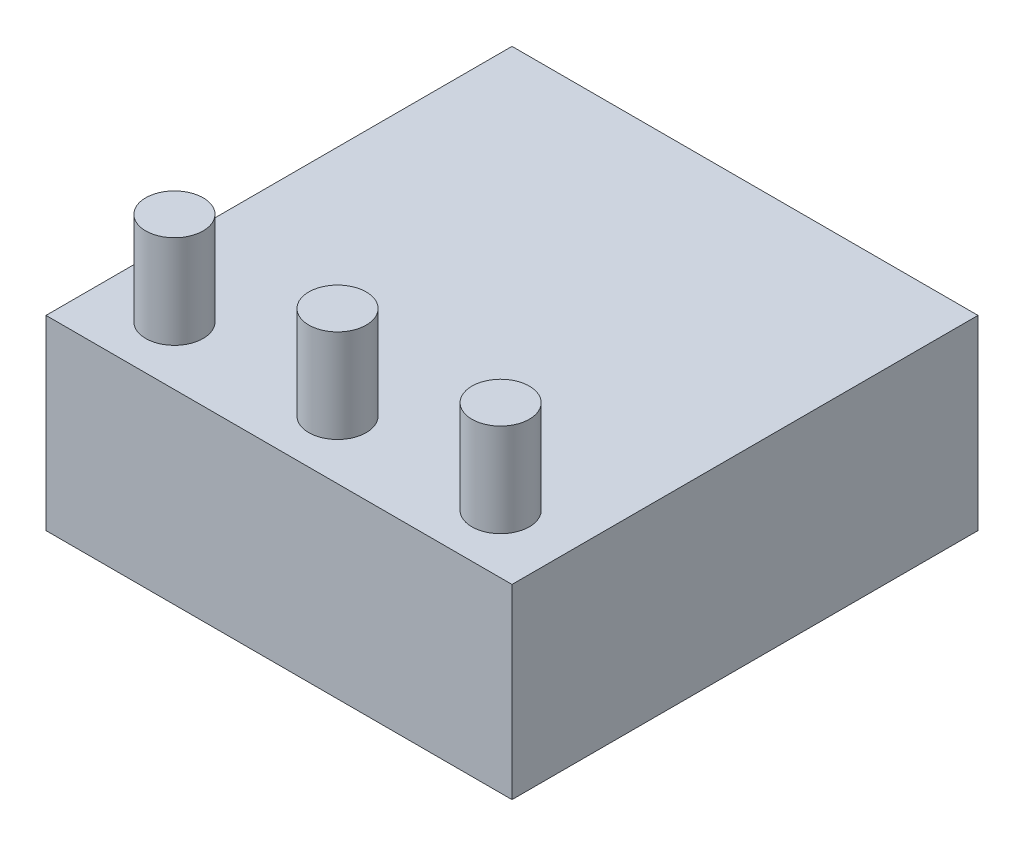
ISO-10303-21;
HEADER;
FILE_DESCRIPTION(('STEP AP214'),'2;1');
FILE_NAME('part.step','',(''),(''),'','','');
FILE_SCHEMA(('AUTOMOTIVE_DESIGN { 1 0 10303 214 1 1 1 1 }'));
ENDSEC;
DATA;
#1=APPLICATION_CONTEXT('core data for automotive mechanical design processes');
#2=APPLICATION_PROTOCOL_DEFINITION('international standard','automotive_design',2000,#1);
#3=PRODUCT_CONTEXT('',#1,'mechanical');
#4=PRODUCT('Part','Part','',(#3));
#5=PRODUCT_RELATED_PRODUCT_CATEGORY('part','',(#4));
#6=PRODUCT_DEFINITION_FORMATION('','',#4);
#7=PRODUCT_DEFINITION_CONTEXT('part definition',#1,'design');
#8=PRODUCT_DEFINITION('design','',#6,#7);
#9=PRODUCT_DEFINITION_SHAPE('','',#8);
#10=(LENGTH_UNIT() NAMED_UNIT(*) SI_UNIT(.MILLI.,.METRE.));
#11=(NAMED_UNIT(*) PLANE_ANGLE_UNIT() SI_UNIT($,.RADIAN.));
#12=(NAMED_UNIT(*) SI_UNIT($,.STERADIAN.) SOLID_ANGLE_UNIT());
#13=UNCERTAINTY_MEASURE_WITH_UNIT(LENGTH_MEASURE(1.E-05),#10,'distance_accuracy_value','');
#14=(GEOMETRIC_REPRESENTATION_CONTEXT(3) GLOBAL_UNCERTAINTY_ASSIGNED_CONTEXT((#13)) GLOBAL_UNIT_ASSIGNED_CONTEXT((#10,
#11,#12)) REPRESENTATION_CONTEXT('',''));
#15=CARTESIAN_POINT('',(0.,0.,0.));
#16=DIRECTION('',(0.,0.,1.));
#17=DIRECTION('',(1.,0.,0.));
#18=AXIS2_PLACEMENT_3D('',#15,#16,#17);
#19=CARTESIAN_POINT('',(-25.,20.,-25.));
#20=DIRECTION('',(0.,1.,0.));
#21=DIRECTION('',(0.,0.,1.));
#22=AXIS2_PLACEMENT_3D('',#19,#20,#21);
#23=PLANE('',#22);
#24=CARTESIAN_POINT('',(0.,20.,18.7197592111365));
#25=DIRECTION('',(0.,1.,0.));
#26=DIRECTION('',(0.,0.,1.));
#27=AXIS2_PLACEMENT_3D('',#24,#25,#26);
#28=CIRCLE('',#27,3.07985755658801);
#29=CARTESIAN_POINT('',(0.,20.,21.7996167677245));
#30=VERTEX_POINT('',#29);
#31=EDGE_CURVE('E125',#30,#30,#28,.T.);
#32=ORIENTED_EDGE('',*,*,#31,.F.);
#33=EDGE_LOOP('',(#32));
#34=FACE_BOUND('',#33,.T.);
#35=DIRECTION('',(0.,0.,1.));
#36=VECTOR('',#35,1.);
#37=CARTESIAN_POINT('',(-25.,20.,-25.));
#38=LINE('',#37,#36);
#39=CARTESIAN_POINT('',(-25.,20.,-25.));
#40=VERTEX_POINT('',#39);
#41=CARTESIAN_POINT('',(-25.,20.,25.));
#42=VERTEX_POINT('',#41);
#43=EDGE_CURVE('E99',#40,#42,#38,.T.);
#44=ORIENTED_EDGE('',*,*,#43,.T.);
#45=DIRECTION('',(1.,0.,0.));
#46=VECTOR('',#45,1.);
#47=CARTESIAN_POINT('',(-25.,20.,25.));
#48=LINE('',#47,#46);
#49=CARTESIAN_POINT('',(25.,20.,25.));
#50=VERTEX_POINT('',#49);
#51=EDGE_CURVE('E84',#42,#50,#48,.T.);
#52=ORIENTED_EDGE('',*,*,#51,.T.);
#53=DIRECTION('',(0.,0.,-1.));
#54=VECTOR('',#53,1.);
#55=CARTESIAN_POINT('',(25.,20.,-25.));
#56=LINE('',#55,#54);
#57=CARTESIAN_POINT('',(25.,20.,-25.));
#58=VERTEX_POINT('',#57);
#59=EDGE_CURVE('E51',#50,#58,#56,.T.);
#60=ORIENTED_EDGE('',*,*,#59,.T.);
#61=DIRECTION('',(-1.,0.,0.));
#62=VECTOR('',#61,1.);
#63=CARTESIAN_POINT('',(-25.,20.,-25.));
#64=LINE('',#63,#62);
#65=EDGE_CURVE('E46',#58,#40,#64,.T.);
#66=ORIENTED_EDGE('',*,*,#65,.T.);
#67=EDGE_LOOP('',(#44,#52,#60,#66));
#68=FACE_BOUND('',#67,.T.);
#69=CARTESIAN_POINT('',(17.5,20.,18.7197592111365));
#70=DIRECTION('',(0.,1.,0.));
#71=DIRECTION('',(0.,0.,1.));
#72=AXIS2_PLACEMENT_3D('',#69,#70,#71);
#73=CIRCLE('',#72,3.07985755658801);
#74=CARTESIAN_POINT('',(17.5,20.,21.7996167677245));
#75=VERTEX_POINT('',#74);
#76=EDGE_CURVE('E92',#75,#75,#73,.T.);
#77=ORIENTED_EDGE('',*,*,#76,.F.);
#78=EDGE_LOOP('',(#77));
#79=FACE_BOUND('',#78,.T.);
#80=CARTESIAN_POINT('',(-17.5,20.,18.7197592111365));
#81=DIRECTION('',(0.,1.,0.));
#82=DIRECTION('',(0.,0.,1.));
#83=AXIS2_PLACEMENT_3D('',#80,#81,#82);
#84=CIRCLE('',#83,3.07985755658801);
#85=CARTESIAN_POINT('',(-17.5,20.,21.7996167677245));
#86=VERTEX_POINT('',#85);
#87=EDGE_CURVE('E120',#86,#86,#84,.T.);
#88=ORIENTED_EDGE('',*,*,#87,.F.);
#89=EDGE_LOOP('',(#88));
#90=FACE_BOUND('',#89,.T.);
#91=ADVANCED_FACE('F31',(#34,#68,#79,#90),#23,.T.);
#92=CARTESIAN_POINT('',(-25.,20.,-25.));
#93=DIRECTION('',(1.,0.,0.));
#94=DIRECTION('',(0.,0.,-1.));
#95=AXIS2_PLACEMENT_3D('',#92,#93,#94);
#96=PLANE('',#95);
#97=DIRECTION('',(0.,0.,1.));
#98=VECTOR('',#97,1.);
#99=CARTESIAN_POINT('',(-25.,0.,-25.));
#100=LINE('',#99,#98);
#101=CARTESIAN_POINT('',(-25.,0.,-25.));
#102=VERTEX_POINT('',#101);
#103=CARTESIAN_POINT('',(-25.,0.,25.));
#104=VERTEX_POINT('',#103);
#105=EDGE_CURVE('E76',#102,#104,#100,.T.);
#106=ORIENTED_EDGE('',*,*,#105,.T.);
#107=DIRECTION('',(0.,-1.,0.));
#108=VECTOR('',#107,1.);
#109=CARTESIAN_POINT('',(-25.,20.,25.));
#110=LINE('',#109,#108);
#111=EDGE_CURVE('E11',#42,#104,#110,.T.);
#112=ORIENTED_EDGE('',*,*,#111,.F.);
#113=ORIENTED_EDGE('',*,*,#43,.F.);
#114=DIRECTION('',(0.,-1.,0.));
#115=VECTOR('',#114,1.);
#116=CARTESIAN_POINT('',(-25.,20.,-25.));
#117=LINE('',#116,#115);
#118=EDGE_CURVE('E88',#40,#102,#117,.T.);
#119=ORIENTED_EDGE('',*,*,#118,.T.);
#120=EDGE_LOOP('',(#106,#112,#113,#119));
#121=FACE_BOUND('',#120,.T.);
#122=ADVANCED_FACE('F33',(#121),#96,.F.);
#123=CARTESIAN_POINT('',(-25.,20.,25.));
#124=DIRECTION('',(0.,0.,-1.));
#125=DIRECTION('',(-1.,0.,0.));
#126=AXIS2_PLACEMENT_3D('',#123,#124,#125);
#127=PLANE('',#126);
#128=DIRECTION('',(1.,0.,0.));
#129=VECTOR('',#128,1.);
#130=CARTESIAN_POINT('',(-25.,0.,25.));
#131=LINE('',#130,#129);
#132=CARTESIAN_POINT('',(25.,0.,25.));
#133=VERTEX_POINT('',#132);
#134=EDGE_CURVE('E72',#104,#133,#131,.T.);
#135=ORIENTED_EDGE('',*,*,#134,.T.);
#136=DIRECTION('',(0.,-1.,0.));
#137=VECTOR('',#136,1.);
#138=CARTESIAN_POINT('',(25.,20.,25.));
#139=LINE('',#138,#137);
#140=EDGE_CURVE('E39',#50,#133,#139,.T.);
#141=ORIENTED_EDGE('',*,*,#140,.F.);
#142=ORIENTED_EDGE('',*,*,#51,.F.);
#143=ORIENTED_EDGE('',*,*,#111,.T.);
#144=EDGE_LOOP('',(#135,#141,#142,#143));
#145=FACE_BOUND('',#144,.T.);
#146=ADVANCED_FACE('F83',(#145),#127,.F.);
#147=CARTESIAN_POINT('',(25.,20.,-25.));
#148=DIRECTION('',(-1.,0.,0.));
#149=DIRECTION('',(0.,0.,1.));
#150=AXIS2_PLACEMENT_3D('',#147,#148,#149);
#151=PLANE('',#150);
#152=DIRECTION('',(0.,0.,-1.));
#153=VECTOR('',#152,1.);
#154=CARTESIAN_POINT('',(25.,0.,-25.));
#155=LINE('',#154,#153);
#156=CARTESIAN_POINT('',(25.,0.,-25.));
#157=VERTEX_POINT('',#156);
#158=EDGE_CURVE('E77',#133,#157,#155,.T.);
#159=ORIENTED_EDGE('',*,*,#158,.T.);
#160=DIRECTION('',(0.,-1.,0.));
#161=VECTOR('',#160,1.);
#162=CARTESIAN_POINT('',(25.,20.,-25.));
#163=LINE('',#162,#161);
#164=EDGE_CURVE('E105',#58,#157,#163,.T.);
#165=ORIENTED_EDGE('',*,*,#164,.F.);
#166=ORIENTED_EDGE('',*,*,#59,.F.);
#167=ORIENTED_EDGE('',*,*,#140,.T.);
#168=EDGE_LOOP('',(#159,#165,#166,#167));
#169=FACE_BOUND('',#168,.T.);
#170=ADVANCED_FACE('F108',(#169),#151,.F.);
#171=CARTESIAN_POINT('',(-25.,20.,-25.));
#172=DIRECTION('',(0.,0.,1.));
#173=DIRECTION('',(1.,0.,0.));
#174=AXIS2_PLACEMENT_3D('',#171,#172,#173);
#175=PLANE('',#174);
#176=DIRECTION('',(-1.,0.,0.));
#177=VECTOR('',#176,1.);
#178=CARTESIAN_POINT('',(-25.,0.,-25.));
#179=LINE('',#178,#177);
#180=EDGE_CURVE('E97',#157,#102,#179,.T.);
#181=ORIENTED_EDGE('',*,*,#180,.T.);
#182=ORIENTED_EDGE('',*,*,#118,.F.);
#183=ORIENTED_EDGE('',*,*,#65,.F.);
#184=ORIENTED_EDGE('',*,*,#164,.T.);
#185=EDGE_LOOP('',(#181,#182,#183,#184));
#186=FACE_BOUND('',#185,.T.);
#187=ADVANCED_FACE('F110',(#186),#175,.F.);
#188=CARTESIAN_POINT('',(-25.,0.,-25.));
#189=DIRECTION('',(0.,1.,0.));
#190=DIRECTION('',(0.,0.,1.));
#191=AXIS2_PLACEMENT_3D('',#188,#189,#190);
#192=PLANE('',#191);
#193=ORIENTED_EDGE('',*,*,#105,.F.);
#194=ORIENTED_EDGE('',*,*,#180,.F.);
#195=ORIENTED_EDGE('',*,*,#158,.F.);
#196=ORIENTED_EDGE('',*,*,#134,.F.);
#197=EDGE_LOOP('',(#193,#194,#195,#196));
#198=FACE_BOUND('',#197,.T.);
#199=ADVANCED_FACE('F73',(#198),#192,.F.);
#200=CARTESIAN_POINT('',(17.5,30.,18.7197592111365));
#201=DIRECTION('',(0.,-1.,0.));
#202=DIRECTION('',(0.,0.,-1.));
#203=AXIS2_PLACEMENT_3D('',#200,#201,#202);
#204=CYLINDRICAL_SURFACE('',#203,3.07985755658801);
#205=CARTESIAN_POINT('',(17.5,30.,18.7197592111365));
#206=DIRECTION('',(0.,1.,0.));
#207=DIRECTION('',(0.,0.,1.));
#208=AXIS2_PLACEMENT_3D('',#205,#206,#207);
#209=CIRCLE('',#208,3.07985755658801);
#210=CARTESIAN_POINT('',(17.5,30.,21.7996167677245));
#211=VERTEX_POINT('',#210);
#212=EDGE_CURVE('E89',#211,#211,#209,.T.);
#213=ORIENTED_EDGE('',*,*,#212,.F.);
#214=EDGE_LOOP('',(#213));
#215=FACE_BOUND('',#214,.T.);
#216=ORIENTED_EDGE('',*,*,#76,.T.);
#217=EDGE_LOOP('',(#216));
#218=FACE_BOUND('',#217,.T.);
#219=ADVANCED_FACE('F133',(#215,#218),#204,.T.);
#220=CARTESIAN_POINT('',(17.5,30.,18.7197592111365));
#221=DIRECTION('',(0.,1.,0.));
#222=DIRECTION('',(0.,0.,1.));
#223=AXIS2_PLACEMENT_3D('',#220,#221,#222);
#224=PLANE('',#223);
#225=ORIENTED_EDGE('',*,*,#212,.T.);
#226=EDGE_LOOP('',(#225));
#227=FACE_BOUND('',#226,.T.);
#228=ADVANCED_FACE('F135',(#227),#224,.T.);
#229=CARTESIAN_POINT('',(0.,30.,18.7197592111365));
#230=DIRECTION('',(0.,-1.,0.));
#231=DIRECTION('',(0.,0.,-1.));
#232=AXIS2_PLACEMENT_3D('',#229,#230,#231);
#233=CYLINDRICAL_SURFACE('',#232,3.07985755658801);
#234=CARTESIAN_POINT('',(0.,30.,18.7197592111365));
#235=DIRECTION('',(0.,1.,0.));
#236=DIRECTION('',(0.,0.,1.));
#237=AXIS2_PLACEMENT_3D('',#234,#235,#236);
#238=CIRCLE('',#237,3.07985755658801);
#239=CARTESIAN_POINT('',(0.,30.,21.7996167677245));
#240=VERTEX_POINT('',#239);
#241=EDGE_CURVE('E130',#240,#240,#238,.T.);
#242=ORIENTED_EDGE('',*,*,#241,.F.);
#243=EDGE_LOOP('',(#242));
#244=FACE_BOUND('',#243,.T.);
#245=ORIENTED_EDGE('',*,*,#31,.T.);
#246=EDGE_LOOP('',(#245));
#247=FACE_BOUND('',#246,.T.);
#248=ADVANCED_FACE('F142',(#244,#247),#233,.T.);
#249=CARTESIAN_POINT('',(0.,30.,18.7197592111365));
#250=DIRECTION('',(0.,1.,0.));
#251=DIRECTION('',(0.,0.,1.));
#252=AXIS2_PLACEMENT_3D('',#249,#250,#251);
#253=PLANE('',#252);
#254=ORIENTED_EDGE('',*,*,#241,.T.);
#255=EDGE_LOOP('',(#254));
#256=FACE_BOUND('',#255,.T.);
#257=ADVANCED_FACE('F185',(#256),#253,.T.);
#258=CARTESIAN_POINT('',(-17.5,30.,18.7197592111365));
#259=DIRECTION('',(0.,-1.,0.));
#260=DIRECTION('',(0.,0.,-1.));
#261=AXIS2_PLACEMENT_3D('',#258,#259,#260);
#262=CYLINDRICAL_SURFACE('',#261,3.07985755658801);
#263=CARTESIAN_POINT('',(-17.5,30.,18.7197592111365));
#264=DIRECTION('',(0.,1.,0.));
#265=DIRECTION('',(0.,0.,1.));
#266=AXIS2_PLACEMENT_3D('',#263,#264,#265);
#267=CIRCLE('',#266,3.07985755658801);
#268=CARTESIAN_POINT('',(-17.5,30.,21.7996167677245));
#269=VERTEX_POINT('',#268);
#270=EDGE_CURVE('E122',#269,#269,#267,.T.);
#271=ORIENTED_EDGE('',*,*,#270,.F.);
#272=EDGE_LOOP('',(#271));
#273=FACE_BOUND('',#272,.T.);
#274=ORIENTED_EDGE('',*,*,#87,.T.);
#275=EDGE_LOOP('',(#274));
#276=FACE_BOUND('',#275,.T.);
#277=ADVANCED_FACE('F194',(#273,#276),#262,.T.);
#278=CARTESIAN_POINT('',(-17.5,30.,18.7197592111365));
#279=DIRECTION('',(0.,1.,0.));
#280=DIRECTION('',(0.,0.,1.));
#281=AXIS2_PLACEMENT_3D('',#278,#279,#280);
#282=PLANE('',#281);
#283=ORIENTED_EDGE('',*,*,#270,.T.);
#284=EDGE_LOOP('',(#283));
#285=FACE_BOUND('',#284,.T.);
#286=ADVANCED_FACE('F204',(#285),#282,.T.);
#287=CLOSED_SHELL('',(#91,#122,#146,#170,#187,#199,#219,#228,#248,#257,#277,#286));
#288=MANIFOLD_SOLID_BREP('B2',#287);
#289=ADVANCED_BREP_SHAPE_REPRESENTATION('',(#18,#288),#14);
#290=SHAPE_DEFINITION_REPRESENTATION(#9,#289);
ENDSEC;
END-ISO-10303-21;
